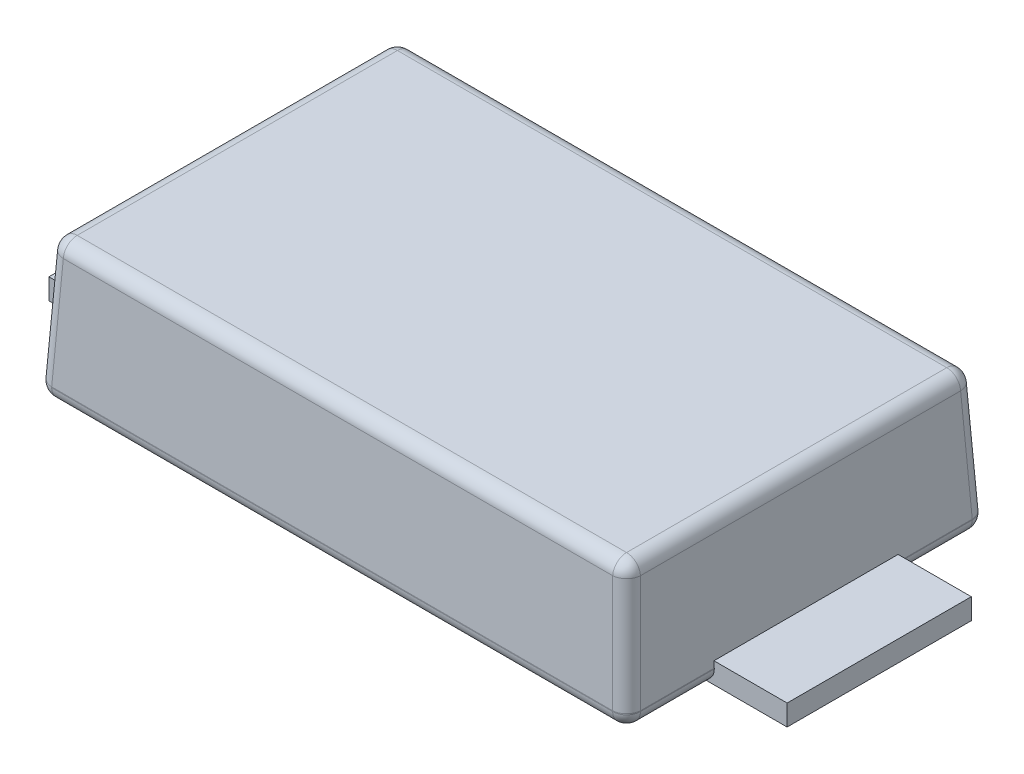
ISO-10303-21;
HEADER;
FILE_DESCRIPTION(('STEP AP214'),'2;1');
FILE_NAME('part.step','',(''),(''),'','','');
FILE_SCHEMA(('AUTOMOTIVE_DESIGN { 1 0 10303 214 1 1 1 1 }'));
ENDSEC;
DATA;
#1=APPLICATION_CONTEXT('core data for automotive mechanical design processes');
#2=APPLICATION_PROTOCOL_DEFINITION('international standard','automotive_design',2000,#1);
#3=PRODUCT_CONTEXT('',#1,'mechanical');
#4=PRODUCT('Part','Part','',(#3));
#5=PRODUCT_RELATED_PRODUCT_CATEGORY('part','',(#4));
#6=PRODUCT_DEFINITION_FORMATION('','',#4);
#7=PRODUCT_DEFINITION_CONTEXT('part definition',#1,'design');
#8=PRODUCT_DEFINITION('design','',#6,#7);
#9=PRODUCT_DEFINITION_SHAPE('','',#8);
#10=(LENGTH_UNIT() NAMED_UNIT(*) SI_UNIT(.MILLI.,.METRE.));
#11=(NAMED_UNIT(*) PLANE_ANGLE_UNIT() SI_UNIT($,.RADIAN.));
#12=(NAMED_UNIT(*) SI_UNIT($,.STERADIAN.) SOLID_ANGLE_UNIT());
#13=UNCERTAINTY_MEASURE_WITH_UNIT(LENGTH_MEASURE(1.E-05),#10,'distance_accuracy_value','');
#14=(GEOMETRIC_REPRESENTATION_CONTEXT(3) GLOBAL_UNCERTAINTY_ASSIGNED_CONTEXT((#13)) GLOBAL_UNIT_ASSIGNED_CONTEXT((#10,
#11,#12)) REPRESENTATION_CONTEXT('',''));
#15=CARTESIAN_POINT('',(0.,0.,0.));
#16=DIRECTION('',(0.,0.,1.));
#17=DIRECTION('',(1.,0.,0.));
#18=AXIS2_PLACEMENT_3D('',#15,#16,#17);
#19=CARTESIAN_POINT('',(3.187587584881,0.,0.663));
#20=DIRECTION('',(-1.,0.,0.));
#21=DIRECTION('',(0.,0.,1.));
#22=AXIS2_PLACEMENT_3D('',#19,#20,#21);
#23=PLANE('',#22);
#24=DIRECTION('',(0.,1.,0.));
#25=VECTOR('',#24,1.);
#26=CARTESIAN_POINT('',(3.187587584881,0.,-0.663));
#27=LINE('',#26,#25);
#28=CARTESIAN_POINT('',(3.187587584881,-0.15,-0.663));
#29=VERTEX_POINT('',#28);
#30=CARTESIAN_POINT('',(3.187587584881,0.,-0.663));
#31=VERTEX_POINT('',#30);
#32=EDGE_CURVE('E481',#29,#31,#27,.T.);
#33=ORIENTED_EDGE('',*,*,#32,.T.);
#34=DIRECTION('',(0.,0.,-1.));
#35=VECTOR('',#34,1.);
#36=CARTESIAN_POINT('',(3.187587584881,0.,0.663));
#37=LINE('',#36,#35);
#38=CARTESIAN_POINT('',(3.187587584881,0.,0.663));
#39=VERTEX_POINT('',#38);
#40=EDGE_CURVE('E601',#39,#31,#37,.T.);
#41=ORIENTED_EDGE('',*,*,#40,.F.);
#42=DIRECTION('',(0.,1.,0.));
#43=VECTOR('',#42,1.);
#44=CARTESIAN_POINT('',(3.187587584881,0.,0.663));
#45=LINE('',#44,#43);
#46=CARTESIAN_POINT('',(3.187587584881,-0.15,0.663));
#47=VERTEX_POINT('',#46);
#48=EDGE_CURVE('E19',#47,#39,#45,.T.);
#49=ORIENTED_EDGE('',*,*,#48,.F.);
#50=DIRECTION('',(0.,0.,-1.));
#51=VECTOR('',#50,1.);
#52=CARTESIAN_POINT('',(3.187587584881,-0.15,0.663));
#53=LINE('',#52,#51);
#54=EDGE_CURVE('E10',#47,#29,#53,.T.);
#55=ORIENTED_EDGE('',*,*,#54,.T.);
#56=EDGE_LOOP('',(#33,#41,#49,#55));
#57=FACE_BOUND('',#56,.T.);
#58=ADVANCED_FACE('F16',(#57),#23,.F.);
#59=CARTESIAN_POINT('',(3.187587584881,-0.15,0.663));
#60=DIRECTION('',(0.,1.,0.));
#61=DIRECTION('',(1.,0.,0.));
#62=AXIS2_PLACEMENT_3D('',#59,#60,#61);
#63=PLANE('',#62);
#64=DIRECTION('',(1.,0.,0.));
#65=VECTOR('',#64,1.);
#66=CARTESIAN_POINT('',(3.187587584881,-0.15,-0.663));
#67=LINE('',#66,#65);
#68=CARTESIAN_POINT('',(2.216587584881,-0.15,-0.663));
#69=VERTEX_POINT('',#68);
#70=CARTESIAN_POINT('',(2.563121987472,-0.15,-0.663));
#71=VERTEX_POINT('',#70);
#72=EDGE_CURVE('E466',#69,#71,#67,.T.);
#73=ORIENTED_EDGE('',*,*,#72,.T.);
#74=DIRECTION('',(1.,0.,0.));
#75=VECTOR('',#74,1.);
#76=CARTESIAN_POINT('',(3.187587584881,-0.15,-0.663));
#77=LINE('',#76,#75);
#78=EDGE_CURVE('E484',#71,#29,#77,.T.);
#79=ORIENTED_EDGE('',*,*,#78,.T.);
#80=ORIENTED_EDGE('',*,*,#54,.F.);
#81=DIRECTION('',(1.,0.,0.));
#82=VECTOR('',#81,1.);
#83=CARTESIAN_POINT('',(3.187587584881,-0.15,0.663));
#84=LINE('',#83,#82);
#85=CARTESIAN_POINT('',(2.563121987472,-0.15,0.663));
#86=VERTEX_POINT('',#85);
#87=EDGE_CURVE('E662',#86,#47,#84,.T.);
#88=ORIENTED_EDGE('',*,*,#87,.F.);
#89=DIRECTION('',(1.,0.,0.));
#90=VECTOR('',#89,1.);
#91=CARTESIAN_POINT('',(3.187587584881,-0.15,0.663));
#92=LINE('',#91,#90);
#93=CARTESIAN_POINT('',(2.216587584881,-0.15,0.663));
#94=VERTEX_POINT('',#93);
#95=EDGE_CURVE('E497',#94,#86,#92,.T.);
#96=ORIENTED_EDGE('',*,*,#95,.F.);
#97=DIRECTION('',(0.,0.,-1.));
#98=VECTOR('',#97,1.);
#99=CARTESIAN_POINT('',(2.216587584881,-0.15,0.663));
#100=LINE('',#99,#98);
#101=EDGE_CURVE('E470',#94,#69,#100,.T.);
#102=ORIENTED_EDGE('',*,*,#101,.T.);
#103=EDGE_LOOP('',(#73,#79,#80,#88,#96,#102));
#104=FACE_BOUND('',#103,.T.);
#105=ADVANCED_FACE('F748',(#104),#63,.F.);
#106=CARTESIAN_POINT('',(1.417,0.15,0.663));
#107=DIRECTION('',(0.,0.,-1.));
#108=DIRECTION('',(0.,-1.,0.));
#109=AXIS2_PLACEMENT_3D('',#106,#107,#108);
#110=PLANE('',#109);
#111=DIRECTION('',(0.0523359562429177,-0.998629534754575,0.));
#112=VECTOR('',#111,1.);
#113=CARTESIAN_POINT('',(2.6685,-0.15,0.663));
#114=LINE('',#113,#112);
#115=CARTESIAN_POINT('',(2.660638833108,0.,0.663));
#116=VERTEX_POINT('',#115);
#117=CARTESIAN_POINT('',(2.662984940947,-0.04476640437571,0.663));
#118=VERTEX_POINT('',#117);
#119=EDGE_CURVE('E465',#116,#118,#114,.T.);
#120=ORIENTED_EDGE('',*,*,#119,.T.);
#121=CARTESIAN_POINT('',(2.563121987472,-0.05,0.663));
#122=DIRECTION('',(0.,0.,-1.));
#123=DIRECTION('',(-1.,0.,0.));
#124=AXIS2_PLACEMENT_3D('',#121,#122,#123);
#125=CIRCLE('',#124,0.1);
#126=CARTESIAN_POINT('',(2.663121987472,-0.05,0.663));
#127=VERTEX_POINT('',#126);
#128=EDGE_CURVE('E418',#118,#127,#125,.T.);
#129=ORIENTED_EDGE('',*,*,#128,.T.);
#130=CARTESIAN_POINT('',(2.563121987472,-0.05,0.663));
#131=DIRECTION('',(0.,0.,-1.));
#132=DIRECTION('',(-1.,0.,0.));
#133=AXIS2_PLACEMENT_3D('',#130,#131,#132);
#134=CIRCLE('',#133,0.1);
#135=EDGE_CURVE('E342',#127,#86,#134,.T.);
#136=ORIENTED_EDGE('',*,*,#135,.T.);
#137=ORIENTED_EDGE('',*,*,#87,.T.);
#138=ORIENTED_EDGE('',*,*,#48,.T.);
#139=DIRECTION('',(-1.,0.,0.));
#140=VECTOR('',#139,1.);
#141=CARTESIAN_POINT('',(2.276138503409,0.,0.663));
#142=LINE('',#141,#140);
#143=EDGE_CURVE('E453',#39,#116,#142,.T.);
#144=ORIENTED_EDGE('',*,*,#143,.T.);
#145=EDGE_LOOP('',(#120,#129,#136,#137,#138,#144));
#146=FACE_BOUND('',#145,.T.);
#147=ADVANCED_FACE('F672',(#146),#110,.F.);
#148=CARTESIAN_POINT('',(1.417,0.15,-0.663));
#149=DIRECTION('',(0.,0.,-1.));
#150=DIRECTION('',(0.,-1.,0.));
#151=AXIS2_PLACEMENT_3D('',#148,#149,#150);
#152=PLANE('',#151);
#153=CARTESIAN_POINT('',(2.563121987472,-0.05,-0.663));
#154=DIRECTION('',(0.,0.,1.));
#155=DIRECTION('',(-1.,0.,0.));
#156=AXIS2_PLACEMENT_3D('',#153,#154,#155);
#157=CIRCLE('',#156,0.1);
#158=CARTESIAN_POINT('',(2.663121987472,-0.05,-0.663));
#159=VERTEX_POINT('',#158);
#160=EDGE_CURVE('E284',#71,#159,#157,.T.);
#161=ORIENTED_EDGE('',*,*,#160,.T.);
#162=CARTESIAN_POINT('',(2.563121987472,-0.05,-0.663));
#163=DIRECTION('',(0.,0.,1.));
#164=DIRECTION('',(-1.,0.,0.));
#165=AXIS2_PLACEMENT_3D('',#162,#163,#164);
#166=CIRCLE('',#165,0.1);
#167=CARTESIAN_POINT('',(2.662984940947,-0.04476640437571,-0.663));
#168=VERTEX_POINT('',#167);
#169=EDGE_CURVE('E542',#159,#168,#166,.T.);
#170=ORIENTED_EDGE('',*,*,#169,.T.);
#171=DIRECTION('',(0.0523359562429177,-0.998629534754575,0.));
#172=VECTOR('',#171,1.);
#173=CARTESIAN_POINT('',(2.6685,-0.15,-0.663));
#174=LINE('',#173,#172);
#175=CARTESIAN_POINT('',(2.660638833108,0.,-0.663));
#176=VERTEX_POINT('',#175);
#177=EDGE_CURVE('E553',#176,#168,#174,.T.);
#178=ORIENTED_EDGE('',*,*,#177,.F.);
#179=DIRECTION('',(-1.,0.,0.));
#180=VECTOR('',#179,1.);
#181=CARTESIAN_POINT('',(2.276138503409,0.,-0.663));
#182=LINE('',#181,#180);
#183=EDGE_CURVE('E485',#31,#176,#182,.T.);
#184=ORIENTED_EDGE('',*,*,#183,.F.);
#185=ORIENTED_EDGE('',*,*,#32,.F.);
#186=ORIENTED_EDGE('',*,*,#78,.F.);
#187=EDGE_LOOP('',(#161,#170,#178,#184,#185,#186));
#188=FACE_BOUND('',#187,.T.);
#189=ADVANCED_FACE('F747',(#188),#152,.T.);
#190=CARTESIAN_POINT('',(2.276138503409,0.,0.663));
#191=DIRECTION('',(0.,-1.,0.));
#192=DIRECTION('',(0.,0.,-1.));
#193=AXIS2_PLACEMENT_3D('',#190,#191,#192);
#194=PLANE('',#193);
#195=DIRECTION('',(0.,0.,1.));
#196=VECTOR('',#195,1.);
#197=CARTESIAN_POINT('',(2.660638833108,0.,-1.3));
#198=LINE('',#197,#196);
#199=EDGE_CURVE('E550',#176,#116,#198,.T.);
#200=ORIENTED_EDGE('',*,*,#199,.T.);
#201=ORIENTED_EDGE('',*,*,#143,.F.);
#202=ORIENTED_EDGE('',*,*,#40,.T.);
#203=ORIENTED_EDGE('',*,*,#183,.T.);
#204=EDGE_LOOP('',(#200,#201,#202,#203));
#205=FACE_BOUND('',#204,.T.);
#206=ADVANCED_FACE('F677',(#205),#194,.F.);
#207=CARTESIAN_POINT('',(-2.127861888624,-0.15,0.663));
#208=DIRECTION('',(0.,1.,0.));
#209=DIRECTION('',(1.,0.,0.));
#210=AXIS2_PLACEMENT_3D('',#207,#208,#209);
#211=PLANE('',#210);
#212=DIRECTION('',(1.,0.,0.));
#213=VECTOR('',#212,1.);
#214=CARTESIAN_POINT('',(-2.127861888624,-0.15,-0.663));
#215=LINE('',#214,#213);
#216=CARTESIAN_POINT('',(-2.127861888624,-0.15,-0.663));
#217=VERTEX_POINT('',#216);
#218=CARTESIAN_POINT('',(-1.476121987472,-0.15,-0.663));
#219=VERTEX_POINT('',#218);
#220=EDGE_CURVE('E610',#217,#219,#215,.T.);
#221=ORIENTED_EDGE('',*,*,#220,.T.);
#222=DIRECTION('',(-1.,0.,0.));
#223=VECTOR('',#222,1.);
#224=CARTESIAN_POINT('',(-1.5815,-0.15,-0.663));
#225=LINE('',#224,#223);
#226=CARTESIAN_POINT('',(-1.156861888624,-0.15,-0.663));
#227=VERTEX_POINT('',#226);
#228=EDGE_CURVE('E510',#227,#219,#225,.T.);
#229=ORIENTED_EDGE('',*,*,#228,.F.);
#230=DIRECTION('',(0.,0.,-1.));
#231=VECTOR('',#230,1.);
#232=CARTESIAN_POINT('',(-1.156861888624,-0.15,0.663));
#233=LINE('',#232,#231);
#234=CARTESIAN_POINT('',(-1.156861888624,-0.15,0.663));
#235=VERTEX_POINT('',#234);
#236=EDGE_CURVE('E506',#235,#227,#233,.T.);
#237=ORIENTED_EDGE('',*,*,#236,.F.);
#238=DIRECTION('',(-1.,0.,0.));
#239=VECTOR('',#238,1.);
#240=CARTESIAN_POINT('',(-1.5815,-0.15,0.663));
#241=LINE('',#240,#239);
#242=CARTESIAN_POINT('',(-1.476121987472,-0.15,0.663));
#243=VERTEX_POINT('',#242);
#244=EDGE_CURVE('E511',#235,#243,#241,.T.);
#245=ORIENTED_EDGE('',*,*,#244,.T.);
#246=DIRECTION('',(1.,0.,0.));
#247=VECTOR('',#246,1.);
#248=CARTESIAN_POINT('',(-2.127861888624,-0.15,0.663));
#249=LINE('',#248,#247);
#250=CARTESIAN_POINT('',(-2.127861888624,-0.15,0.663));
#251=VERTEX_POINT('',#250);
#252=EDGE_CURVE('E528',#251,#243,#249,.T.);
#253=ORIENTED_EDGE('',*,*,#252,.F.);
#254=DIRECTION('',(0.,0.,-1.));
#255=VECTOR('',#254,1.);
#256=CARTESIAN_POINT('',(-2.127861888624,-0.15,0.663));
#257=LINE('',#256,#255);
#258=EDGE_CURVE('E450',#251,#217,#257,.T.);
#259=ORIENTED_EDGE('',*,*,#258,.T.);
#260=EDGE_LOOP('',(#221,#229,#237,#245,#253,#259));
#261=FACE_BOUND('',#260,.T.);
#262=ADVANCED_FACE('F720',(#261),#211,.F.);
#263=CARTESIAN_POINT('',(-2.127861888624,0.,0.663));
#264=DIRECTION('',(1.,0.,0.));
#265=DIRECTION('',(0.,1.,0.));
#266=AXIS2_PLACEMENT_3D('',#263,#264,#265);
#267=PLANE('',#266);
#268=DIRECTION('',(0.,-1.,0.));
#269=VECTOR('',#268,1.);
#270=CARTESIAN_POINT('',(-2.127861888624,0.,-0.663));
#271=LINE('',#270,#269);
#272=CARTESIAN_POINT('',(-2.127861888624,0.,-0.663));
#273=VERTEX_POINT('',#272);
#274=EDGE_CURVE('E454',#273,#217,#271,.T.);
#275=ORIENTED_EDGE('',*,*,#274,.T.);
#276=ORIENTED_EDGE('',*,*,#258,.F.);
#277=DIRECTION('',(0.,-1.,0.));
#278=VECTOR('',#277,1.);
#279=CARTESIAN_POINT('',(-2.127861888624,0.,0.663));
#280=LINE('',#279,#278);
#281=CARTESIAN_POINT('',(-2.127861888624,0.,0.663));
#282=VERTEX_POINT('',#281);
#283=EDGE_CURVE('E524',#282,#251,#280,.T.);
#284=ORIENTED_EDGE('',*,*,#283,.F.);
#285=DIRECTION('',(0.,0.,-1.));
#286=VECTOR('',#285,1.);
#287=CARTESIAN_POINT('',(-2.127861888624,0.,0.663));
#288=LINE('',#287,#286);
#289=EDGE_CURVE('E529',#282,#273,#288,.T.);
#290=ORIENTED_EDGE('',*,*,#289,.T.);
#291=EDGE_LOOP('',(#275,#276,#284,#290));
#292=FACE_BOUND('',#291,.T.);
#293=ADVANCED_FACE('F764',(#292),#267,.F.);
#294=CARTESIAN_POINT('',(-0.965,0.,-0.663));
#295=DIRECTION('',(0.,0.,-1.));
#296=DIRECTION('',(0.,-1.,0.));
#297=AXIS2_PLACEMENT_3D('',#294,#295,#296);
#298=PLANE('',#297);
#299=DIRECTION('',(0.0523359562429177,0.998629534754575,0.));
#300=VECTOR('',#299,1.);
#301=CARTESIAN_POINT('',(-1.5815,-0.15,-0.663));
#302=LINE('',#301,#300);
#303=CARTESIAN_POINT('',(-1.575984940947,-0.04476640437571,-0.663));
#304=VERTEX_POINT('',#303);
#305=CARTESIAN_POINT('',(-1.573638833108,0.,-0.663));
#306=VERTEX_POINT('',#305);
#307=EDGE_CURVE('E359',#304,#306,#302,.T.);
#308=ORIENTED_EDGE('',*,*,#307,.F.);
#309=CARTESIAN_POINT('',(-1.476121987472,-0.05,-0.663));
#310=DIRECTION('',(0.,0.,1.));
#311=DIRECTION('',(-1.,0.,0.));
#312=AXIS2_PLACEMENT_3D('',#309,#310,#311);
#313=CIRCLE('',#312,0.1);
#314=CARTESIAN_POINT('',(-1.576121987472,-0.05,-0.663));
#315=VERTEX_POINT('',#314);
#316=EDGE_CURVE('E460',#304,#315,#313,.T.);
#317=ORIENTED_EDGE('',*,*,#316,.T.);
#318=CARTESIAN_POINT('',(-1.476121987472,-0.05,-0.663));
#319=DIRECTION('',(0.,0.,1.));
#320=DIRECTION('',(-1.,0.,0.));
#321=AXIS2_PLACEMENT_3D('',#318,#319,#320);
#322=CIRCLE('',#321,0.1);
#323=EDGE_CURVE('E302',#315,#219,#322,.T.);
#324=ORIENTED_EDGE('',*,*,#323,.T.);
#325=ORIENTED_EDGE('',*,*,#220,.F.);
#326=ORIENTED_EDGE('',*,*,#274,.F.);
#327=DIRECTION('',(-1.,0.,0.));
#328=VECTOR('',#327,1.);
#329=CARTESIAN_POINT('',(-1.240893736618,0.,-0.663));
#330=LINE('',#329,#328);
#331=EDGE_CURVE('E533',#306,#273,#330,.T.);
#332=ORIENTED_EDGE('',*,*,#331,.F.);
#333=EDGE_LOOP('',(#308,#317,#324,#325,#326,#332));
#334=FACE_BOUND('',#333,.T.);
#335=ADVANCED_FACE('F727',(#334),#298,.T.);
#336=CARTESIAN_POINT('',(-0.965,0.,0.663));
#337=DIRECTION('',(0.,0.,-1.));
#338=DIRECTION('',(0.,-1.,0.));
#339=AXIS2_PLACEMENT_3D('',#336,#337,#338);
#340=PLANE('',#339);
#341=CARTESIAN_POINT('',(-1.476121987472,-0.05,0.663));
#342=DIRECTION('',(0.,0.,-1.));
#343=DIRECTION('',(-1.,0.,0.));
#344=AXIS2_PLACEMENT_3D('',#341,#342,#343);
#345=CIRCLE('',#344,0.1);
#346=CARTESIAN_POINT('',(-1.576121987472,-0.05,0.663));
#347=VERTEX_POINT('',#346);
#348=EDGE_CURVE('E374',#243,#347,#345,.T.);
#349=ORIENTED_EDGE('',*,*,#348,.T.);
#350=CARTESIAN_POINT('',(-1.476121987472,-0.05,0.663));
#351=DIRECTION('',(0.,0.,-1.));
#352=DIRECTION('',(-1.,0.,0.));
#353=AXIS2_PLACEMENT_3D('',#350,#351,#352);
#354=CIRCLE('',#353,0.1);
#355=CARTESIAN_POINT('',(-1.575984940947,-0.04476640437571,0.663));
#356=VERTEX_POINT('',#355);
#357=EDGE_CURVE('E404',#347,#356,#354,.T.);
#358=ORIENTED_EDGE('',*,*,#357,.T.);
#359=DIRECTION('',(0.0523359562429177,0.998629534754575,0.));
#360=VECTOR('',#359,1.);
#361=CARTESIAN_POINT('',(-1.5815,-0.15,0.663));
#362=LINE('',#361,#360);
#363=CARTESIAN_POINT('',(-1.573638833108,0.,0.663));
#364=VERTEX_POINT('',#363);
#365=EDGE_CURVE('E449',#356,#364,#362,.T.);
#366=ORIENTED_EDGE('',*,*,#365,.T.);
#367=DIRECTION('',(-1.,0.,0.));
#368=VECTOR('',#367,1.);
#369=CARTESIAN_POINT('',(-1.240893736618,0.,0.663));
#370=LINE('',#369,#368);
#371=EDGE_CURVE('E647',#364,#282,#370,.T.);
#372=ORIENTED_EDGE('',*,*,#371,.T.);
#373=ORIENTED_EDGE('',*,*,#283,.T.);
#374=ORIENTED_EDGE('',*,*,#252,.T.);
#375=EDGE_LOOP('',(#349,#358,#366,#372,#373,#374));
#376=FACE_BOUND('',#375,.T.);
#377=ADVANCED_FACE('F767',(#376),#340,.F.);
#378=CARTESIAN_POINT('',(-1.240893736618,0.,0.663));
#379=DIRECTION('',(0.,-1.,0.));
#380=DIRECTION('',(0.,0.,-1.));
#381=AXIS2_PLACEMENT_3D('',#378,#379,#380);
#382=PLANE('',#381);
#383=ORIENTED_EDGE('',*,*,#371,.F.);
#384=DIRECTION('',(0.,0.,-1.));
#385=VECTOR('',#384,1.);
#386=CARTESIAN_POINT('',(-1.573638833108,0.,-1.3));
#387=LINE('',#386,#385);
#388=EDGE_CURVE('E429',#364,#306,#387,.T.);
#389=ORIENTED_EDGE('',*,*,#388,.T.);
#390=ORIENTED_EDGE('',*,*,#331,.T.);
#391=ORIENTED_EDGE('',*,*,#289,.F.);
#392=EDGE_LOOP('',(#383,#389,#390,#391));
#393=FACE_BOUND('',#392,.T.);
#394=ADVANCED_FACE('F770',(#393),#382,.F.);
#395=CARTESIAN_POINT('',(-1.5815,0.75,-1.152695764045));
#396=DIRECTION('',(-1.,0.,0.));
#397=DIRECTION('',(0.,0.,1.));
#398=AXIS2_PLACEMENT_3D('',#395,#396,#397);
#399=CYLINDRICAL_SURFACE('',#398,0.1);
#400=CARTESIAN_POINT('',(2.521195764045,0.75,-1.152695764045));
#401=DIRECTION('',(-1.,0.,0.));
#402=DIRECTION('',(0.,1.,0.));
#403=AXIS2_PLACEMENT_3D('',#400,#401,#402);
#404=CIRCLE('',#403,0.1);
#405=CARTESIAN_POINT('',(2.521195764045,0.85,-1.152695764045));
#406=VERTEX_POINT('',#405);
#407=CARTESIAN_POINT('',(2.521195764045,0.755233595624,-1.252558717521));
#408=VERTEX_POINT('',#407);
#409=EDGE_CURVE('E383',#406,#408,#404,.T.);
#410=ORIENTED_EDGE('',*,*,#409,.T.);
#411=DIRECTION('',(1.,0.,0.));
#412=VECTOR('',#411,1.);
#413=CARTESIAN_POINT('',(2.616092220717,0.755233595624,-1.252558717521));
#414=LINE('',#413,#412);
#415=CARTESIAN_POINT('',(-1.434195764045,0.755233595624,-1.252558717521));
#416=VERTEX_POINT('',#415);
#417=EDGE_CURVE('E571',#416,#408,#414,.T.);
#418=ORIENTED_EDGE('',*,*,#417,.F.);
#419=CARTESIAN_POINT('',(-1.434195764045,0.75,-1.152695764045));
#420=DIRECTION('',(1.,0.,0.));
#421=DIRECTION('',(0.,0.,1.));
#422=AXIS2_PLACEMENT_3D('',#419,#420,#421);
#423=CIRCLE('',#422,0.1);
#424=CARTESIAN_POINT('',(-1.434195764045,0.85,-1.152695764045));
#425=VERTEX_POINT('',#424);
#426=EDGE_CURVE('E386',#416,#425,#423,.T.);
#427=ORIENTED_EDGE('',*,*,#426,.T.);
#428=DIRECTION('',(-1.,0.,0.));
#429=VECTOR('',#428,1.);
#430=CARTESIAN_POINT('',(-1.529092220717,0.85,-1.152695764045));
#431=LINE('',#430,#429);
#432=EDGE_CURVE('E490',#406,#425,#431,.T.);
#433=ORIENTED_EDGE('',*,*,#432,.F.);
#434=EDGE_LOOP('',(#410,#418,#427,#433));
#435=FACE_BOUND('',#434,.T.);
#436=ADVANCED_FACE('F774',(#435),#399,.T.);
#437=CARTESIAN_POINT('',(-1.434195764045,0.75,-1.152695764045));
#438=DIRECTION('',(0.,1.,0.));
#439=DIRECTION('',(1.,0.,0.));
#440=AXIS2_PLACEMENT_3D('',#437,#438,#439);
#441=SPHERICAL_SURFACE('',#440,0.1);
#442=CARTESIAN_POINT('',(-1.434195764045,0.75,-1.152695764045));
#443=DIRECTION('',(0.0522644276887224,0.997264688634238,0.0522644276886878));
#444=DIRECTION('',(0.,-0.0523359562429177,0.998629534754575));
#445=AXIS2_PLACEMENT_3D('',#442,#443,#444);
#446=CIRCLE('',#445,0.1);
#447=CARTESIAN_POINT('',(-1.534058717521,0.755233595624,-1.152695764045));
#448=VERTEX_POINT('',#447);
#449=EDGE_CURVE('E387',#416,#448,#446,.T.);
#450=ORIENTED_EDGE('',*,*,#449,.T.);
#451=CARTESIAN_POINT('',(-1.434195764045,0.75,-1.152695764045));
#452=DIRECTION('',(0.,0.,-1.));
#453=DIRECTION('',(-1.,0.,0.));
#454=AXIS2_PLACEMENT_3D('',#451,#452,#453);
#455=CIRCLE('',#454,0.1);
#456=EDGE_CURVE('E639',#448,#425,#455,.T.);
#457=ORIENTED_EDGE('',*,*,#456,.T.);
#458=ORIENTED_EDGE('',*,*,#426,.F.);
#459=EDGE_LOOP('',(#450,#457,#458));
#460=FACE_BOUND('',#459,.T.);
#461=ADVANCED_FACE('F778',(#460),#441,.T.);
#462=CARTESIAN_POINT('',(2.521195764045,0.75,-1.152695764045));
#463=DIRECTION('',(0.,1.,0.));
#464=DIRECTION('',(1.,0.,0.));
#465=AXIS2_PLACEMENT_3D('',#462,#463,#464);
#466=SPHERICAL_SURFACE('',#465,0.1);
#467=CARTESIAN_POINT('',(2.521195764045,0.75,-1.152695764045));
#468=DIRECTION('',(0.,0.,-1.));
#469=DIRECTION('',(-1.,0.,0.));
#470=AXIS2_PLACEMENT_3D('',#467,#468,#469);
#471=CIRCLE('',#470,0.1);
#472=CARTESIAN_POINT('',(2.621058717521,0.755233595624,-1.152695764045));
#473=VERTEX_POINT('',#472);
#474=EDGE_CURVE('E576',#406,#473,#471,.T.);
#475=ORIENTED_EDGE('',*,*,#474,.T.);
#476=CARTESIAN_POINT('',(2.521195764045,0.75,-1.152695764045));
#477=DIRECTION('',(-0.0522644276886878,0.997264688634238,0.0522644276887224));
#478=DIRECTION('',(-0.998629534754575,-0.0523359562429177,0.));
#479=AXIS2_PLACEMENT_3D('',#476,#477,#478);
#480=CIRCLE('',#479,0.1);
#481=EDGE_CURVE('E572',#473,#408,#480,.T.);
#482=ORIENTED_EDGE('',*,*,#481,.T.);
#483=ORIENTED_EDGE('',*,*,#409,.F.);
#484=EDGE_LOOP('',(#475,#482,#483));
#485=FACE_BOUND('',#484,.T.);
#486=ADVANCED_FACE('F780',(#485),#466,.T.);
#487=CARTESIAN_POINT('',(-1.481909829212,-0.160438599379,-1.200409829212));
#488=DIRECTION('',(-0.0522644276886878,-0.997264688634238,-0.0522644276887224));
#489=DIRECTION('',(0.998629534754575,-0.0523359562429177,0.));
#490=AXIS2_PLACEMENT_3D('',#487,#488,#489);
#491=CYLINDRICAL_SURFACE('',#490,0.1);
#492=CARTESIAN_POINT('',(-1.476121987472,-0.05,-1.194621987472));
#493=DIRECTION('',(0.0522644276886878,0.997264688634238,0.0522644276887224));
#494=DIRECTION('',(0.998629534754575,-0.0523359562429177,0.));
#495=AXIS2_PLACEMENT_3D('',#492,#493,#494);
#496=CIRCLE('',#495,0.1);
#497=CARTESIAN_POINT('',(-1.476121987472,-0.04476640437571,-1.294484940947));
#498=VERTEX_POINT('',#497);
#499=CARTESIAN_POINT('',(-1.575984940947,-0.04476640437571,-1.194621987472));
#500=VERTEX_POINT('',#499);
#501=EDGE_CURVE('E577',#498,#500,#496,.T.);
#502=ORIENTED_EDGE('',*,*,#501,.T.);
#503=DIRECTION('',(-0.0522644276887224,-0.997264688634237,-0.0522644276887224));
#504=VECTOR('',#503,1.);
#505=CARTESIAN_POINT('',(-1.581772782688,-0.155205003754,-1.200409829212));
#506=LINE('',#505,#504);
#507=EDGE_CURVE('E360',#448,#500,#506,.T.);
#508=ORIENTED_EDGE('',*,*,#507,.F.);
#509=ORIENTED_EDGE('',*,*,#449,.F.);
#510=DIRECTION('',(0.0522644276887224,0.997264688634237,0.0522644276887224));
#511=VECTOR('',#510,1.);
#512=CARTESIAN_POINT('',(-1.481909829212,-0.155205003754,-1.300272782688));
#513=LINE('',#512,#511);
#514=EDGE_CURVE('E564',#498,#416,#513,.T.);
#515=ORIENTED_EDGE('',*,*,#514,.F.);
#516=EDGE_LOOP('',(#502,#508,#509,#515));
#517=FACE_BOUND('',#516,.T.);
#518=ADVANCED_FACE('F783',(#517),#491,.T.);
#519=CARTESIAN_POINT('',(-1.434195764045,0.75,1.3));
#520=DIRECTION('',(0.,0.,1.));
#521=DIRECTION('',(1.,0.,0.));
#522=AXIS2_PLACEMENT_3D('',#519,#520,#521);
#523=CYLINDRICAL_SURFACE('',#522,0.1);
#524=CARTESIAN_POINT('',(-1.434195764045,0.75,1.152695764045));
#525=DIRECTION('',(0.,0.,-1.));
#526=DIRECTION('',(1.,0.,0.));
#527=AXIS2_PLACEMENT_3D('',#524,#525,#526);
#528=CIRCLE('',#527,0.1);
#529=CARTESIAN_POINT('',(-1.534058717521,0.755233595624,1.152695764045));
#530=VERTEX_POINT('',#529);
#531=CARTESIAN_POINT('',(-1.434195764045,0.85,1.152695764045));
#532=VERTEX_POINT('',#531);
#533=EDGE_CURVE('E632',#530,#532,#528,.T.);
#534=ORIENTED_EDGE('',*,*,#533,.T.);
#535=DIRECTION('',(0.,0.,1.));
#536=VECTOR('',#535,1.);
#537=CARTESIAN_POINT('',(-1.434195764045,0.85,1.247592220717));
#538=LINE('',#537,#536);
#539=EDGE_CURVE('E440',#425,#532,#538,.T.);
#540=ORIENTED_EDGE('',*,*,#539,.F.);
#541=ORIENTED_EDGE('',*,*,#456,.F.);
#542=DIRECTION('',(0.,0.,-1.));
#543=VECTOR('',#542,1.);
#544=CARTESIAN_POINT('',(-1.534058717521,0.755233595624,-1.247592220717));
#545=LINE('',#544,#543);
#546=EDGE_CURVE('E352',#530,#448,#545,.T.);
#547=ORIENTED_EDGE('',*,*,#546,.F.);
#548=EDGE_LOOP('',(#534,#540,#541,#547));
#549=FACE_BOUND('',#548,.T.);
#550=ADVANCED_FACE('F787',(#549),#523,.T.);
#551=CARTESIAN_POINT('',(2.521195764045,0.75,1.3));
#552=DIRECTION('',(0.,0.,-1.));
#553=DIRECTION('',(-1.,0.,0.));
#554=AXIS2_PLACEMENT_3D('',#551,#552,#553);
#555=CYLINDRICAL_SURFACE('',#554,0.1);
#556=CARTESIAN_POINT('',(2.521195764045,0.75,1.152695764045));
#557=DIRECTION('',(0.,0.,-1.));
#558=DIRECTION('',(0.,-1.,0.));
#559=AXIS2_PLACEMENT_3D('',#556,#557,#558);
#560=CIRCLE('',#559,0.1);
#561=CARTESIAN_POINT('',(2.521195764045,0.85,1.152695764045));
#562=VERTEX_POINT('',#561);
#563=CARTESIAN_POINT('',(2.621058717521,0.755233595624,1.152695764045));
#564=VERTEX_POINT('',#563);
#565=EDGE_CURVE('E591',#562,#564,#560,.T.);
#566=ORIENTED_EDGE('',*,*,#565,.T.);
#567=DIRECTION('',(0.,0.,1.));
#568=VECTOR('',#567,1.);
#569=CARTESIAN_POINT('',(2.621058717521,0.755233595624,1.247592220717));
#570=LINE('',#569,#568);
#571=EDGE_CURVE('E394',#473,#564,#570,.T.);
#572=ORIENTED_EDGE('',*,*,#571,.F.);
#573=ORIENTED_EDGE('',*,*,#474,.F.);
#574=DIRECTION('',(0.,0.,-1.));
#575=VECTOR('',#574,1.);
#576=CARTESIAN_POINT('',(2.521195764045,0.85,-1.247592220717));
#577=LINE('',#576,#575);
#578=EDGE_CURVE('E486',#562,#406,#577,.T.);
#579=ORIENTED_EDGE('',*,*,#578,.F.);
#580=EDGE_LOOP('',(#566,#572,#573,#579));
#581=FACE_BOUND('',#580,.T.);
#582=ADVANCED_FACE('F789',(#581),#555,.T.);
#583=CARTESIAN_POINT('',(2.557300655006,0.06107764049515,-1.188800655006));
#584=DIRECTION('',(0.0522644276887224,-0.997264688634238,-0.0522644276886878));
#585=DIRECTION('',(0.,0.0523359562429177,-0.998629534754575));
#586=AXIS2_PLACEMENT_3D('',#583,#584,#585);
#587=CYLINDRICAL_SURFACE('',#586,0.1);
#588=CARTESIAN_POINT('',(2.563121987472,-0.05,-1.194621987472));
#589=DIRECTION('',(-0.0522644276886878,0.997264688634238,0.0522644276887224));
#590=DIRECTION('',(0.998629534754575,0.0523359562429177,0.));
#591=AXIS2_PLACEMENT_3D('',#588,#589,#590);
#592=CIRCLE('',#591,0.1);
#593=CARTESIAN_POINT('',(2.662984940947,-0.04476640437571,-1.194621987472));
#594=VERTEX_POINT('',#593);
#595=CARTESIAN_POINT('',(2.563121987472,-0.04476640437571,-1.294484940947));
#596=VERTEX_POINT('',#595);
#597=EDGE_CURVE('E588',#594,#596,#592,.T.);
#598=ORIENTED_EDGE('',*,*,#597,.T.);
#599=DIRECTION('',(0.0522644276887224,-0.997264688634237,-0.0522644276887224));
#600=VECTOR('',#599,1.);
#601=CARTESIAN_POINT('',(2.557300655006,0.06631123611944,-1.288663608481));
#602=LINE('',#601,#600);
#603=EDGE_CURVE('E581',#408,#596,#602,.T.);
#604=ORIENTED_EDGE('',*,*,#603,.F.);
#605=ORIENTED_EDGE('',*,*,#481,.F.);
#606=DIRECTION('',(-0.0522644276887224,0.997264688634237,0.0522644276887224));
#607=VECTOR('',#606,1.);
#608=CARTESIAN_POINT('',(2.668772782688,-0.155205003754,-1.200409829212));
#609=LINE('',#608,#607);
#610=EDGE_CURVE('E390',#594,#473,#609,.T.);
#611=ORIENTED_EDGE('',*,*,#610,.F.);
#612=EDGE_LOOP('',(#598,#604,#605,#611));
#613=FACE_BOUND('',#612,.T.);
#614=ADVANCED_FACE('F792',(#613),#587,.T.);
#615=CARTESIAN_POINT('',(-1.476121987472,-0.05,-1.194621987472));
#616=DIRECTION('',(0.,1.,0.));
#617=DIRECTION('',(1.,0.,0.));
#618=AXIS2_PLACEMENT_3D('',#615,#616,#617);
#619=SPHERICAL_SURFACE('',#618,0.1);
#620=CARTESIAN_POINT('',(-1.476121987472,-0.05,-1.194621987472));
#621=DIRECTION('',(-1.,0.,0.));
#622=DIRECTION('',(0.,-1.,0.));
#623=AXIS2_PLACEMENT_3D('',#620,#621,#622);
#624=CIRCLE('',#623,0.1);
#625=CARTESIAN_POINT('',(-1.476121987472,-0.05,-1.294621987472));
#626=VERTEX_POINT('',#625);
#627=EDGE_CURVE('E459',#498,#626,#624,.T.);
#628=ORIENTED_EDGE('',*,*,#627,.T.);
#629=CARTESIAN_POINT('',(-1.476121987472,-0.05,-1.194621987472));
#630=DIRECTION('',(-1.,0.,0.));
#631=DIRECTION('',(0.,-1.,0.));
#632=AXIS2_PLACEMENT_3D('',#629,#630,#631);
#633=CIRCLE('',#632,0.1);
#634=CARTESIAN_POINT('',(-1.476121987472,-0.15,-1.194621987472));
#635=VERTEX_POINT('',#634);
#636=EDGE_CURVE('E312',#626,#635,#633,.T.);
#637=ORIENTED_EDGE('',*,*,#636,.T.);
#638=CARTESIAN_POINT('',(-1.476121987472,-0.05,-1.194621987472));
#639=DIRECTION('',(0.,0.,-1.));
#640=DIRECTION('',(-1.,0.,0.));
#641=AXIS2_PLACEMENT_3D('',#638,#639,#640);
#642=CIRCLE('',#641,0.1);
#643=CARTESIAN_POINT('',(-1.576121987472,-0.05,-1.194621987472));
#644=VERTEX_POINT('',#643);
#645=EDGE_CURVE('E338',#635,#644,#642,.T.);
#646=ORIENTED_EDGE('',*,*,#645,.T.);
#647=CARTESIAN_POINT('',(-1.476121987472,-0.05,-1.194621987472));
#648=DIRECTION('',(0.,0.,-1.));
#649=DIRECTION('',(-1.,0.,0.));
#650=AXIS2_PLACEMENT_3D('',#647,#648,#649);
#651=CIRCLE('',#650,0.1);
#652=EDGE_CURVE('E455',#644,#500,#651,.T.);
#653=ORIENTED_EDGE('',*,*,#652,.T.);
#654=ORIENTED_EDGE('',*,*,#501,.F.);
#655=EDGE_LOOP('',(#628,#637,#646,#653,#654));
#656=FACE_BOUND('',#655,.T.);
#657=ADVANCED_FACE('F733',(#656),#619,.T.);
#658=CARTESIAN_POINT('',(-1.434195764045,0.75,1.152695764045));
#659=DIRECTION('',(0.,1.,0.));
#660=DIRECTION('',(1.,0.,0.));
#661=AXIS2_PLACEMENT_3D('',#658,#659,#660);
#662=SPHERICAL_SURFACE('',#661,0.1);
#663=CARTESIAN_POINT('',(-1.434195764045,0.75,1.152695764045));
#664=DIRECTION('',(0.0522644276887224,0.997264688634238,-0.0522644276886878));
#665=DIRECTION('',(0.,0.0523359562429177,0.998629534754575));
#666=AXIS2_PLACEMENT_3D('',#663,#664,#665);
#667=CIRCLE('',#666,0.1);
#668=CARTESIAN_POINT('',(-1.434195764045,0.755233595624,1.252558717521));
#669=VERTEX_POINT('',#668);
#670=EDGE_CURVE('E504',#530,#669,#667,.T.);
#671=ORIENTED_EDGE('',*,*,#670,.T.);
#672=CARTESIAN_POINT('',(-1.434195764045,0.75,1.152695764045));
#673=DIRECTION('',(-1.,0.,0.));
#674=DIRECTION('',(0.,0.,1.));
#675=AXIS2_PLACEMENT_3D('',#672,#673,#674);
#676=CIRCLE('',#675,0.1);
#677=EDGE_CURVE('E505',#669,#532,#676,.T.);
#678=ORIENTED_EDGE('',*,*,#677,.T.);
#679=ORIENTED_EDGE('',*,*,#533,.F.);
#680=EDGE_LOOP('',(#671,#678,#679));
#681=FACE_BOUND('',#680,.T.);
#682=ADVANCED_FACE('F797',(#681),#662,.T.);
#683=CARTESIAN_POINT('',(2.521195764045,0.75,1.152695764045));
#684=DIRECTION('',(0.,1.,0.));
#685=DIRECTION('',(1.,0.,0.));
#686=AXIS2_PLACEMENT_3D('',#683,#684,#685);
#687=SPHERICAL_SURFACE('',#686,0.1);
#688=CARTESIAN_POINT('',(2.521195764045,0.75,1.152695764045));
#689=DIRECTION('',(1.,0.,0.));
#690=DIRECTION('',(0.,0.,-1.));
#691=AXIS2_PLACEMENT_3D('',#688,#689,#690);
#692=CIRCLE('',#691,0.1);
#693=CARTESIAN_POINT('',(2.521195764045,0.755233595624,1.252558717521));
#694=VERTEX_POINT('',#693);
#695=EDGE_CURVE('E501',#562,#694,#692,.T.);
#696=ORIENTED_EDGE('',*,*,#695,.T.);
#697=CARTESIAN_POINT('',(2.521195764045,0.75,1.152695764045));
#698=DIRECTION('',(-0.0522644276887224,0.997264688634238,-0.0522644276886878));
#699=DIRECTION('',(0.,0.0523359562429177,0.998629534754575));
#700=AXIS2_PLACEMENT_3D('',#697,#698,#699);
#701=CIRCLE('',#700,0.1);
#702=EDGE_CURVE('E592',#694,#564,#701,.T.);
#703=ORIENTED_EDGE('',*,*,#702,.T.);
#704=ORIENTED_EDGE('',*,*,#565,.F.);
#705=EDGE_LOOP('',(#696,#703,#704));
#706=FACE_BOUND('',#705,.T.);
#707=ADVANCED_FACE('F800',(#706),#687,.T.);
#708=CARTESIAN_POINT('',(2.563121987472,-0.05,-1.194621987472));
#709=DIRECTION('',(0.,1.,0.));
#710=DIRECTION('',(1.,0.,0.));
#711=AXIS2_PLACEMENT_3D('',#708,#709,#710);
#712=SPHERICAL_SURFACE('',#711,0.1);
#713=CARTESIAN_POINT('',(2.563121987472,-0.05,-1.194621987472));
#714=DIRECTION('',(0.,-1.,0.));
#715=DIRECTION('',(0.,0.,-1.));
#716=AXIS2_PLACEMENT_3D('',#713,#714,#715);
#717=CIRCLE('',#716,0.1);
#718=CARTESIAN_POINT('',(2.563121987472,-0.05,-1.294621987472));
#719=VERTEX_POINT('',#718);
#720=CARTESIAN_POINT('',(2.663121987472,-0.05,-1.194621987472));
#721=VERTEX_POINT('',#720);
#722=EDGE_CURVE('E310',#719,#721,#717,.T.);
#723=ORIENTED_EDGE('',*,*,#722,.F.);
#724=CARTESIAN_POINT('',(2.563121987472,-0.05,-1.194621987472));
#725=DIRECTION('',(1.,0.,0.));
#726=DIRECTION('',(0.,0.,-1.));
#727=AXIS2_PLACEMENT_3D('',#724,#725,#726);
#728=CIRCLE('',#727,0.1);
#729=EDGE_CURVE('E567',#719,#596,#728,.T.);
#730=ORIENTED_EDGE('',*,*,#729,.T.);
#731=ORIENTED_EDGE('',*,*,#597,.F.);
#732=CARTESIAN_POINT('',(2.563121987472,-0.05,-1.194621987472));
#733=DIRECTION('',(0.,0.,-1.));
#734=DIRECTION('',(-1.,0.,0.));
#735=AXIS2_PLACEMENT_3D('',#732,#733,#734);
#736=CIRCLE('',#735,0.1);
#737=EDGE_CURVE('E539',#594,#721,#736,.T.);
#738=ORIENTED_EDGE('',*,*,#737,.T.);
#739=EDGE_LOOP('',(#723,#730,#731,#738));
#740=FACE_BOUND('',#739,.T.);
#741=ADVANCED_FACE('F739',(#740),#712,.T.);
#742=CARTESIAN_POINT('',(-1.5815,-0.05,-1.194621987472));
#743=DIRECTION('',(1.,0.,0.));
#744=DIRECTION('',(0.,0.,-1.));
#745=AXIS2_PLACEMENT_3D('',#742,#743,#744);
#746=CYLINDRICAL_SURFACE('',#745,0.1);
#747=DIRECTION('',(1.,0.,0.));
#748=VECTOR('',#747,1.);
#749=CARTESIAN_POINT('',(-1.5815,-0.05,-1.294621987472));
#750=LINE('',#749,#748);
#751=EDGE_CURVE('E303',#626,#719,#750,.T.);
#752=ORIENTED_EDGE('',*,*,#751,.F.);
#753=ORIENTED_EDGE('',*,*,#627,.F.);
#754=DIRECTION('',(-1.,0.,0.));
#755=VECTOR('',#754,1.);
#756=CARTESIAN_POINT('',(-1.5815,-0.04476640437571,-1.294484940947));
#757=LINE('',#756,#755);
#758=EDGE_CURVE('E491',#596,#498,#757,.T.);
#759=ORIENTED_EDGE('',*,*,#758,.F.);
#760=ORIENTED_EDGE('',*,*,#729,.F.);
#761=EDGE_LOOP('',(#752,#753,#759,#760));
#762=FACE_BOUND('',#761,.T.);
#763=ADVANCED_FACE('F737',(#762),#746,.T.);
#764=CARTESIAN_POINT('',(-1.476121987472,-0.05,-1.3));
#765=DIRECTION('',(0.,0.,-1.));
#766=DIRECTION('',(-1.,0.,0.));
#767=AXIS2_PLACEMENT_3D('',#764,#765,#766);
#768=CYLINDRICAL_SURFACE('',#767,0.1);
#769=DIRECTION('',(0.,0.,-1.));
#770=VECTOR('',#769,1.);
#771=CARTESIAN_POINT('',(-1.576121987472,-0.05,-1.3));
#772=LINE('',#771,#770);
#773=EDGE_CURVE('E364',#315,#644,#772,.T.);
#774=ORIENTED_EDGE('',*,*,#773,.F.);
#775=ORIENTED_EDGE('',*,*,#316,.F.);
#776=DIRECTION('',(0.,0.,1.));
#777=VECTOR('',#776,1.);
#778=CARTESIAN_POINT('',(-1.575984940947,-0.04476640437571,-1.3));
#779=LINE('',#778,#777);
#780=EDGE_CURVE('E355',#500,#304,#779,.T.);
#781=ORIENTED_EDGE('',*,*,#780,.F.);
#782=ORIENTED_EDGE('',*,*,#652,.F.);
#783=EDGE_LOOP('',(#774,#775,#781,#782));
#784=FACE_BOUND('',#783,.T.);
#785=ADVANCED_FACE('F731',(#784),#768,.T.);
#786=CARTESIAN_POINT('',(-1.481909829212,-0.160438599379,1.200409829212));
#787=DIRECTION('',(-0.0522644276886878,-0.997264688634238,0.0522644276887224));
#788=DIRECTION('',(0.998629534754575,-0.0523359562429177,0.));
#789=AXIS2_PLACEMENT_3D('',#786,#787,#788);
#790=CYLINDRICAL_SURFACE('',#789,0.1);
#791=CARTESIAN_POINT('',(-1.476121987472,-0.05,1.194621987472));
#792=DIRECTION('',(0.0522644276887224,0.997264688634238,-0.0522644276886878));
#793=DIRECTION('',(0.,-0.0523359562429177,-0.998629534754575));
#794=AXIS2_PLACEMENT_3D('',#791,#792,#793);
#795=CIRCLE('',#794,0.1);
#796=CARTESIAN_POINT('',(-1.575984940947,-0.04476640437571,1.194621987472));
#797=VERTEX_POINT('',#796);
#798=CARTESIAN_POINT('',(-1.476121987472,-0.04476640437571,1.294484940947));
#799=VERTEX_POINT('',#798);
#800=EDGE_CURVE('E543',#797,#799,#795,.T.);
#801=ORIENTED_EDGE('',*,*,#800,.T.);
#802=DIRECTION('',(-0.0522644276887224,-0.997264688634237,0.0522644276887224));
#803=VECTOR('',#802,1.);
#804=CARTESIAN_POINT('',(-1.481909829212,-0.155205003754,1.300272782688));
#805=LINE('',#804,#803);
#806=EDGE_CURVE('E414',#669,#799,#805,.T.);
#807=ORIENTED_EDGE('',*,*,#806,.F.);
#808=ORIENTED_EDGE('',*,*,#670,.F.);
#809=DIRECTION('',(0.0522644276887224,0.997264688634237,-0.0522644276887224));
#810=VECTOR('',#809,1.);
#811=CARTESIAN_POINT('',(-1.574670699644,-0.01968918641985,1.193307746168));
#812=LINE('',#811,#810);
#813=EDGE_CURVE('E349',#797,#530,#812,.T.);
#814=ORIENTED_EDGE('',*,*,#813,.F.);
#815=EDGE_LOOP('',(#801,#807,#808,#814));
#816=FACE_BOUND('',#815,.T.);
#817=ADVANCED_FACE('F809',(#816),#790,.T.);
#818=CARTESIAN_POINT('',(-1.5815,0.75,1.152695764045));
#819=DIRECTION('',(1.,0.,0.));
#820=DIRECTION('',(0.,0.,-1.));
#821=AXIS2_PLACEMENT_3D('',#818,#819,#820);
#822=CYLINDRICAL_SURFACE('',#821,0.1);
#823=ORIENTED_EDGE('',*,*,#677,.F.);
#824=DIRECTION('',(-1.,0.,0.));
#825=VECTOR('',#824,1.);
#826=CARTESIAN_POINT('',(-1.529092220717,0.755233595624,1.252558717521));
#827=LINE('',#826,#825);
#828=EDGE_CURVE('E326',#694,#669,#827,.T.);
#829=ORIENTED_EDGE('',*,*,#828,.F.);
#830=ORIENTED_EDGE('',*,*,#695,.F.);
#831=DIRECTION('',(1.,0.,0.));
#832=VECTOR('',#831,1.);
#833=CARTESIAN_POINT('',(2.616092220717,0.85,1.152695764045));
#834=LINE('',#833,#832);
#835=EDGE_CURVE('E422',#532,#562,#834,.T.);
#836=ORIENTED_EDGE('',*,*,#835,.F.);
#837=EDGE_LOOP('',(#823,#829,#830,#836));
#838=FACE_BOUND('',#837,.T.);
#839=ADVANCED_FACE('F812',(#838),#822,.T.);
#840=CARTESIAN_POINT('',(2.561807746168,-0.02492278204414,1.193307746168));
#841=DIRECTION('',(0.0522644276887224,-0.997264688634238,0.0522644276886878));
#842=DIRECTION('',(0.,-0.0523359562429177,-0.998629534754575));
#843=AXIS2_PLACEMENT_3D('',#840,#841,#842);
#844=CYLINDRICAL_SURFACE('',#843,0.1);
#845=CARTESIAN_POINT('',(2.563121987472,-0.05,1.194621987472));
#846=DIRECTION('',(-0.0522644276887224,0.997264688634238,-0.0522644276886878));
#847=DIRECTION('',(0.,-0.0523359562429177,-0.998629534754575));
#848=AXIS2_PLACEMENT_3D('',#845,#846,#847);
#849=CIRCLE('',#848,0.1);
#850=CARTESIAN_POINT('',(2.563121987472,-0.04476640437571,1.294484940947));
#851=VERTEX_POINT('',#850);
#852=CARTESIAN_POINT('',(2.662984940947,-0.04476640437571,1.194621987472));
#853=VERTEX_POINT('',#852);
#854=EDGE_CURVE('E407',#851,#853,#849,.T.);
#855=ORIENTED_EDGE('',*,*,#854,.T.);
#856=DIRECTION('',(0.0522644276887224,-0.997264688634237,0.0522644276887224));
#857=VECTOR('',#856,1.);
#858=CARTESIAN_POINT('',(2.661670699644,-0.01968918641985,1.193307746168));
#859=LINE('',#858,#857);
#860=EDGE_CURVE('E413',#564,#853,#859,.T.);
#861=ORIENTED_EDGE('',*,*,#860,.F.);
#862=ORIENTED_EDGE('',*,*,#702,.F.);
#863=DIRECTION('',(-0.0522644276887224,0.997264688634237,-0.0522644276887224));
#864=VECTOR('',#863,1.);
#865=CARTESIAN_POINT('',(2.557300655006,0.06631123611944,1.288663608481));
#866=LINE('',#865,#864);
#867=EDGE_CURVE('E520',#851,#694,#866,.T.);
#868=ORIENTED_EDGE('',*,*,#867,.F.);
#869=EDGE_LOOP('',(#855,#861,#862,#868));
#870=FACE_BOUND('',#869,.T.);
#871=ADVANCED_FACE('F818',(#870),#844,.T.);
#872=CARTESIAN_POINT('',(2.563121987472,-0.05,-1.3));
#873=DIRECTION('',(0.,0.,1.));
#874=DIRECTION('',(1.,0.,0.));
#875=AXIS2_PLACEMENT_3D('',#872,#873,#874);
#876=CYLINDRICAL_SURFACE('',#875,0.1);
#877=DIRECTION('',(0.,0.,1.));
#878=VECTOR('',#877,1.);
#879=CARTESIAN_POINT('',(2.663121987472,-0.05,-1.3));
#880=LINE('',#879,#878);
#881=EDGE_CURVE('E337',#721,#159,#880,.T.);
#882=ORIENTED_EDGE('',*,*,#881,.F.);
#883=ORIENTED_EDGE('',*,*,#737,.F.);
#884=DIRECTION('',(0.,0.,-1.));
#885=VECTOR('',#884,1.);
#886=CARTESIAN_POINT('',(2.662984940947,-0.04476640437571,-1.3));
#887=LINE('',#886,#885);
#888=EDGE_CURVE('E395',#168,#594,#887,.T.);
#889=ORIENTED_EDGE('',*,*,#888,.F.);
#890=ORIENTED_EDGE('',*,*,#169,.F.);
#891=EDGE_LOOP('',(#882,#883,#889,#890));
#892=FACE_BOUND('',#891,.T.);
#893=ADVANCED_FACE('F745',(#892),#876,.T.);
#894=CARTESIAN_POINT('',(-1.476121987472,-0.05,1.194621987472));
#895=DIRECTION('',(0.,1.,0.));
#896=DIRECTION('',(1.,0.,0.));
#897=AXIS2_PLACEMENT_3D('',#894,#895,#896);
#898=SPHERICAL_SURFACE('',#897,0.1);
#899=CARTESIAN_POINT('',(-1.476121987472,-0.05,1.194621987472));
#900=DIRECTION('',(0.,0.,1.));
#901=DIRECTION('',(0.,-1.,0.));
#902=AXIS2_PLACEMENT_3D('',#899,#900,#901);
#903=CIRCLE('',#902,0.1);
#904=CARTESIAN_POINT('',(-1.576121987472,-0.05,1.194621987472));
#905=VERTEX_POINT('',#904);
#906=EDGE_CURVE('E408',#797,#905,#903,.T.);
#907=ORIENTED_EDGE('',*,*,#906,.T.);
#908=CARTESIAN_POINT('',(-1.476121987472,-0.05,1.194621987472));
#909=DIRECTION('',(0.,0.,1.));
#910=DIRECTION('',(0.,-1.,0.));
#911=AXIS2_PLACEMENT_3D('',#908,#909,#910);
#912=CIRCLE('',#911,0.1);
#913=CARTESIAN_POINT('',(-1.476121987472,-0.15,1.194621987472));
#914=VERTEX_POINT('',#913);
#915=EDGE_CURVE('E334',#905,#914,#912,.T.);
#916=ORIENTED_EDGE('',*,*,#915,.T.);
#917=CARTESIAN_POINT('',(-1.476121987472,-0.05,1.194621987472));
#918=DIRECTION('',(-1.,0.,0.));
#919=DIRECTION('',(0.,0.,1.));
#920=AXIS2_PLACEMENT_3D('',#917,#918,#919);
#921=CIRCLE('',#920,0.1);
#922=CARTESIAN_POINT('',(-1.476121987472,-0.05,1.294621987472));
#923=VERTEX_POINT('',#922);
#924=EDGE_CURVE('E343',#914,#923,#921,.T.);
#925=ORIENTED_EDGE('',*,*,#924,.T.);
#926=CARTESIAN_POINT('',(-1.476121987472,-0.05,1.194621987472));
#927=DIRECTION('',(-1.,0.,0.));
#928=DIRECTION('',(0.,0.,1.));
#929=AXIS2_PLACEMENT_3D('',#926,#927,#928);
#930=CIRCLE('',#929,0.1);
#931=EDGE_CURVE('E607',#923,#799,#930,.T.);
#932=ORIENTED_EDGE('',*,*,#931,.T.);
#933=ORIENTED_EDGE('',*,*,#800,.F.);
#934=EDGE_LOOP('',(#907,#916,#925,#932,#933));
#935=FACE_BOUND('',#934,.T.);
#936=ADVANCED_FACE('F710',(#935),#898,.T.);
#937=CARTESIAN_POINT('',(2.563121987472,-0.05,1.194621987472));
#938=DIRECTION('',(0.,1.,0.));
#939=DIRECTION('',(1.,0.,0.));
#940=AXIS2_PLACEMENT_3D('',#937,#938,#939);
#941=SPHERICAL_SURFACE('',#940,0.1);
#942=CARTESIAN_POINT('',(2.563121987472,-0.05,1.194621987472));
#943=DIRECTION('',(0.,-1.,0.));
#944=DIRECTION('',(0.,0.,-1.));
#945=AXIS2_PLACEMENT_3D('',#942,#943,#944);
#946=CIRCLE('',#945,0.1);
#947=CARTESIAN_POINT('',(2.663121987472,-0.05,1.194621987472));
#948=VERTEX_POINT('',#947);
#949=CARTESIAN_POINT('',(2.563121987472,-0.05,1.294621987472));
#950=VERTEX_POINT('',#949);
#951=EDGE_CURVE('E335',#948,#950,#946,.T.);
#952=ORIENTED_EDGE('',*,*,#951,.F.);
#953=CARTESIAN_POINT('',(2.563121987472,-0.05,1.194621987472));
#954=DIRECTION('',(0.,0.,1.));
#955=DIRECTION('',(1.,0.,0.));
#956=AXIS2_PLACEMENT_3D('',#953,#954,#955);
#957=CIRCLE('',#956,0.1);
#958=EDGE_CURVE('E421',#948,#853,#957,.T.);
#959=ORIENTED_EDGE('',*,*,#958,.T.);
#960=ORIENTED_EDGE('',*,*,#854,.F.);
#961=CARTESIAN_POINT('',(2.563121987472,-0.05,1.194621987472));
#962=DIRECTION('',(1.,0.,0.));
#963=DIRECTION('',(0.,0.,-1.));
#964=AXIS2_PLACEMENT_3D('',#961,#962,#963);
#965=CIRCLE('',#964,0.1);
#966=EDGE_CURVE('E477',#851,#950,#965,.T.);
#967=ORIENTED_EDGE('',*,*,#966,.T.);
#968=EDGE_LOOP('',(#952,#959,#960,#967));
#969=FACE_BOUND('',#968,.T.);
#970=ADVANCED_FACE('F703',(#969),#941,.T.);
#971=CARTESIAN_POINT('',(-1.476121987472,-0.05,-1.3));
#972=DIRECTION('',(0.,0.,-1.));
#973=DIRECTION('',(-1.,0.,0.));
#974=AXIS2_PLACEMENT_3D('',#971,#972,#973);
#975=CYLINDRICAL_SURFACE('',#974,0.1);
#976=DIRECTION('',(0.,0.,-1.));
#977=VECTOR('',#976,1.);
#978=CARTESIAN_POINT('',(-1.576121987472,-0.05,-1.3));
#979=LINE('',#978,#977);
#980=EDGE_CURVE('E379',#905,#347,#979,.T.);
#981=ORIENTED_EDGE('',*,*,#980,.F.);
#982=ORIENTED_EDGE('',*,*,#906,.F.);
#983=DIRECTION('',(0.,0.,1.));
#984=VECTOR('',#983,1.);
#985=CARTESIAN_POINT('',(-1.575984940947,-0.04476640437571,-1.3));
#986=LINE('',#985,#984);
#987=EDGE_CURVE('E353',#356,#797,#986,.T.);
#988=ORIENTED_EDGE('',*,*,#987,.F.);
#989=ORIENTED_EDGE('',*,*,#357,.F.);
#990=EDGE_LOOP('',(#981,#982,#988,#989));
#991=FACE_BOUND('',#990,.T.);
#992=ADVANCED_FACE('F834',(#991),#975,.T.);
#993=CARTESIAN_POINT('',(-1.5815,-0.05,1.194621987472));
#994=DIRECTION('',(-1.,0.,0.));
#995=DIRECTION('',(0.,0.,1.));
#996=AXIS2_PLACEMENT_3D('',#993,#994,#995);
#997=CYLINDRICAL_SURFACE('',#996,0.1);
#998=DIRECTION('',(-1.,0.,0.));
#999=VECTOR('',#998,1.);
#1000=CARTESIAN_POINT('',(-1.5815,-0.05,1.294621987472));
#1001=LINE('',#1000,#999);
#1002=EDGE_CURVE('E433',#950,#923,#1001,.T.);
#1003=ORIENTED_EDGE('',*,*,#1002,.F.);
#1004=ORIENTED_EDGE('',*,*,#966,.F.);
#1005=DIRECTION('',(1.,0.,0.));
#1006=VECTOR('',#1005,1.);
#1007=CARTESIAN_POINT('',(-1.5815,-0.04476640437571,1.294484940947));
#1008=LINE('',#1007,#1006);
#1009=EDGE_CURVE('E409',#799,#851,#1008,.T.);
#1010=ORIENTED_EDGE('',*,*,#1009,.F.);
#1011=ORIENTED_EDGE('',*,*,#931,.F.);
#1012=EDGE_LOOP('',(#1003,#1004,#1010,#1011));
#1013=FACE_BOUND('',#1012,.T.);
#1014=ADVANCED_FACE('F708',(#1013),#997,.T.);
#1015=CARTESIAN_POINT('',(2.563121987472,-0.05,-1.3));
#1016=DIRECTION('',(0.,0.,1.));
#1017=DIRECTION('',(1.,0.,0.));
#1018=AXIS2_PLACEMENT_3D('',#1015,#1016,#1017);
#1019=CYLINDRICAL_SURFACE('',#1018,0.1);
#1020=DIRECTION('',(0.,0.,1.));
#1021=VECTOR('',#1020,1.);
#1022=CARTESIAN_POINT('',(2.663121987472,-0.05,-1.3));
#1023=LINE('',#1022,#1021);
#1024=EDGE_CURVE('E396',#127,#948,#1023,.T.);
#1025=ORIENTED_EDGE('',*,*,#1024,.F.);
#1026=ORIENTED_EDGE('',*,*,#128,.F.);
#1027=DIRECTION('',(0.,0.,-1.));
#1028=VECTOR('',#1027,1.);
#1029=CARTESIAN_POINT('',(2.662984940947,-0.04476640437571,-1.3));
#1030=LINE('',#1029,#1028);
#1031=EDGE_CURVE('E461',#853,#118,#1030,.T.);
#1032=ORIENTED_EDGE('',*,*,#1031,.F.);
#1033=ORIENTED_EDGE('',*,*,#958,.F.);
#1034=EDGE_LOOP('',(#1025,#1026,#1032,#1033));
#1035=FACE_BOUND('',#1034,.T.);
#1036=ADVANCED_FACE('F687',(#1035),#1019,.T.);
#1037=CARTESIAN_POINT('',(-1.5815,0.85,1.3));
#1038=DIRECTION('',(0.,1.,0.));
#1039=DIRECTION('',(1.,0.,0.));
#1040=AXIS2_PLACEMENT_3D('',#1037,#1038,#1039);
#1041=PLANE('',#1040);
#1042=ORIENTED_EDGE('',*,*,#578,.T.);
#1043=ORIENTED_EDGE('',*,*,#432,.T.);
#1044=ORIENTED_EDGE('',*,*,#539,.T.);
#1045=ORIENTED_EDGE('',*,*,#835,.T.);
#1046=EDGE_LOOP('',(#1042,#1043,#1044,#1045));
#1047=FACE_BOUND('',#1046,.T.);
#1048=ADVANCED_FACE('F838',(#1047),#1041,.T.);
#1049=CARTESIAN_POINT('',(-1.5815,-0.15,-1.3));
#1050=DIRECTION('',(0.,0.0523359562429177,-0.998629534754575));
#1051=DIRECTION('',(-1.,0.,0.));
#1052=AXIS2_PLACEMENT_3D('',#1049,#1050,#1051);
#1053=PLANE('',#1052);
#1054=ORIENTED_EDGE('',*,*,#514,.T.);
#1055=ORIENTED_EDGE('',*,*,#417,.T.);
#1056=ORIENTED_EDGE('',*,*,#603,.T.);
#1057=ORIENTED_EDGE('',*,*,#758,.T.);
#1058=EDGE_LOOP('',(#1054,#1055,#1056,#1057));
#1059=FACE_BOUND('',#1058,.T.);
#1060=ADVANCED_FACE('F841',(#1059),#1053,.T.);
#1061=CARTESIAN_POINT('',(2.6685,-0.15,-1.3));
#1062=DIRECTION('',(0.998629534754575,0.0523359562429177,0.));
#1063=DIRECTION('',(0.,0.,-1.));
#1064=AXIS2_PLACEMENT_3D('',#1061,#1062,#1063);
#1065=PLANE('',#1064);
#1066=ORIENTED_EDGE('',*,*,#860,.T.);
#1067=ORIENTED_EDGE('',*,*,#1031,.T.);
#1068=ORIENTED_EDGE('',*,*,#119,.F.);
#1069=ORIENTED_EDGE('',*,*,#199,.F.);
#1070=ORIENTED_EDGE('',*,*,#177,.T.);
#1071=ORIENTED_EDGE('',*,*,#888,.T.);
#1072=ORIENTED_EDGE('',*,*,#610,.T.);
#1073=ORIENTED_EDGE('',*,*,#571,.T.);
#1074=EDGE_LOOP('',(#1066,#1067,#1068,#1069,#1070,#1071,#1072,#1073));
#1075=FACE_BOUND('',#1074,.T.);
#1076=ADVANCED_FACE('F682',(#1075),#1065,.T.);
#1077=CARTESIAN_POINT('',(-1.5815,-0.15,1.3));
#1078=DIRECTION('',(0.,0.0523359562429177,0.998629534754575));
#1079=DIRECTION('',(1.,0.,0.));
#1080=AXIS2_PLACEMENT_3D('',#1077,#1078,#1079);
#1081=PLANE('',#1080);
#1082=ORIENTED_EDGE('',*,*,#867,.T.);
#1083=ORIENTED_EDGE('',*,*,#828,.T.);
#1084=ORIENTED_EDGE('',*,*,#806,.T.);
#1085=ORIENTED_EDGE('',*,*,#1009,.T.);
#1086=EDGE_LOOP('',(#1082,#1083,#1084,#1085));
#1087=FACE_BOUND('',#1086,.T.);
#1088=ADVANCED_FACE('F845',(#1087),#1081,.T.);
#1089=CARTESIAN_POINT('',(-1.5815,-0.15,1.3));
#1090=DIRECTION('',(0.,1.,0.));
#1091=DIRECTION('',(1.,0.,0.));
#1092=AXIS2_PLACEMENT_3D('',#1089,#1090,#1091);
#1093=PLANE('',#1092);
#1094=DIRECTION('',(1.,0.,0.));
#1095=VECTOR('',#1094,1.);
#1096=CARTESIAN_POINT('',(-1.5815,-0.15,-1.194621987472));
#1097=LINE('',#1096,#1095);
#1098=CARTESIAN_POINT('',(2.563121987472,-0.15,-1.194621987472));
#1099=VERTEX_POINT('',#1098);
#1100=EDGE_CURVE('E291',#635,#1099,#1097,.T.);
#1101=ORIENTED_EDGE('',*,*,#1100,.T.);
#1102=DIRECTION('',(0.,0.,1.));
#1103=VECTOR('',#1102,1.);
#1104=CARTESIAN_POINT('',(2.563121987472,-0.15,1.3));
#1105=LINE('',#1104,#1103);
#1106=EDGE_CURVE('E276',#1099,#71,#1105,.T.);
#1107=ORIENTED_EDGE('',*,*,#1106,.T.);
#1108=ORIENTED_EDGE('',*,*,#72,.F.);
#1109=ORIENTED_EDGE('',*,*,#101,.F.);
#1110=ORIENTED_EDGE('',*,*,#95,.T.);
#1111=DIRECTION('',(0.,0.,1.));
#1112=VECTOR('',#1111,1.);
#1113=CARTESIAN_POINT('',(2.563121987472,-0.15,1.3));
#1114=LINE('',#1113,#1112);
#1115=CARTESIAN_POINT('',(2.563121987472,-0.15,1.194621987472));
#1116=VERTEX_POINT('',#1115);
#1117=EDGE_CURVE('E400',#86,#1116,#1114,.T.);
#1118=ORIENTED_EDGE('',*,*,#1117,.T.);
#1119=DIRECTION('',(-1.,0.,0.));
#1120=VECTOR('',#1119,1.);
#1121=CARTESIAN_POINT('',(-1.5815,-0.15,1.194621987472));
#1122=LINE('',#1121,#1120);
#1123=EDGE_CURVE('E340',#1116,#914,#1122,.T.);
#1124=ORIENTED_EDGE('',*,*,#1123,.T.);
#1125=DIRECTION('',(0.,0.,-1.));
#1126=VECTOR('',#1125,1.);
#1127=CARTESIAN_POINT('',(-1.476121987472,-0.15,1.3));
#1128=LINE('',#1127,#1126);
#1129=EDGE_CURVE('E378',#914,#243,#1128,.T.);
#1130=ORIENTED_EDGE('',*,*,#1129,.T.);
#1131=ORIENTED_EDGE('',*,*,#244,.F.);
#1132=ORIENTED_EDGE('',*,*,#236,.T.);
#1133=ORIENTED_EDGE('',*,*,#228,.T.);
#1134=DIRECTION('',(0.,0.,-1.));
#1135=VECTOR('',#1134,1.);
#1136=CARTESIAN_POINT('',(-1.476121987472,-0.15,1.3));
#1137=LINE('',#1136,#1135);
#1138=EDGE_CURVE('E295',#219,#635,#1137,.T.);
#1139=ORIENTED_EDGE('',*,*,#1138,.T.);
#1140=EDGE_LOOP('',(#1101,#1107,#1108,#1109,#1110,#1118,#1124,#1130,#1131,#1132,#1133,#1139));
#1141=FACE_BOUND('',#1140,.T.);
#1142=ADVANCED_FACE('F292',(#1141),#1093,.F.);
#1143=CARTESIAN_POINT('',(-1.5815,-0.15,-1.3));
#1144=DIRECTION('',(-0.998629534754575,0.0523359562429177,0.));
#1145=DIRECTION('',(0.,0.,1.));
#1146=AXIS2_PLACEMENT_3D('',#1143,#1144,#1145);
#1147=PLANE('',#1146);
#1148=ORIENTED_EDGE('',*,*,#365,.F.);
#1149=ORIENTED_EDGE('',*,*,#987,.T.);
#1150=ORIENTED_EDGE('',*,*,#813,.T.);
#1151=ORIENTED_EDGE('',*,*,#546,.T.);
#1152=ORIENTED_EDGE('',*,*,#507,.T.);
#1153=ORIENTED_EDGE('',*,*,#780,.T.);
#1154=ORIENTED_EDGE('',*,*,#307,.T.);
#1155=ORIENTED_EDGE('',*,*,#388,.F.);
#1156=EDGE_LOOP('',(#1148,#1149,#1150,#1151,#1152,#1153,#1154,#1155));
#1157=FACE_BOUND('',#1156,.T.);
#1158=ADVANCED_FACE('F848',(#1157),#1147,.T.);
#1159=CARTESIAN_POINT('',(2.563121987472,-0.05,-1.3));
#1160=DIRECTION('',(0.,0.,1.));
#1161=DIRECTION('',(1.,0.,0.));
#1162=AXIS2_PLACEMENT_3D('',#1159,#1160,#1161);
#1163=CYLINDRICAL_SURFACE('',#1162,0.1);
#1164=ORIENTED_EDGE('',*,*,#135,.F.);
#1165=ORIENTED_EDGE('',*,*,#1024,.T.);
#1166=CARTESIAN_POINT('',(2.563121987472,-0.05,1.194621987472));
#1167=DIRECTION('',(0.,0.,1.));
#1168=DIRECTION('',(1.,0.,0.));
#1169=AXIS2_PLACEMENT_3D('',#1166,#1167,#1168);
#1170=CIRCLE('',#1169,0.1);
#1171=EDGE_CURVE('E288',#1116,#948,#1170,.T.);
#1172=ORIENTED_EDGE('',*,*,#1171,.F.);
#1173=ORIENTED_EDGE('',*,*,#1117,.F.);
#1174=EDGE_LOOP('',(#1164,#1165,#1172,#1173));
#1175=FACE_BOUND('',#1174,.T.);
#1176=ADVANCED_FACE('F692',(#1175),#1163,.T.);
#1177=CARTESIAN_POINT('',(-1.5815,-0.05,1.194621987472));
#1178=DIRECTION('',(-1.,0.,0.));
#1179=DIRECTION('',(0.,0.,1.));
#1180=AXIS2_PLACEMENT_3D('',#1177,#1178,#1179);
#1181=CYLINDRICAL_SURFACE('',#1180,0.1);
#1182=CARTESIAN_POINT('',(2.563121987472,-0.05,1.194621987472));
#1183=DIRECTION('',(1.,0.,0.));
#1184=DIRECTION('',(0.,0.,-1.));
#1185=AXIS2_PLACEMENT_3D('',#1182,#1183,#1184);
#1186=CIRCLE('',#1185,0.1);
#1187=EDGE_CURVE('E330',#950,#1116,#1186,.T.);
#1188=ORIENTED_EDGE('',*,*,#1187,.F.);
#1189=ORIENTED_EDGE('',*,*,#1002,.T.);
#1190=ORIENTED_EDGE('',*,*,#924,.F.);
#1191=ORIENTED_EDGE('',*,*,#1123,.F.);
#1192=EDGE_LOOP('',(#1188,#1189,#1190,#1191));
#1193=FACE_BOUND('',#1192,.T.);
#1194=ADVANCED_FACE('F698',(#1193),#1181,.T.);
#1195=CARTESIAN_POINT('',(-1.476121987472,-0.05,-1.3));
#1196=DIRECTION('',(0.,0.,-1.));
#1197=DIRECTION('',(-1.,0.,0.));
#1198=AXIS2_PLACEMENT_3D('',#1195,#1196,#1197);
#1199=CYLINDRICAL_SURFACE('',#1198,0.1);
#1200=ORIENTED_EDGE('',*,*,#915,.F.);
#1201=ORIENTED_EDGE('',*,*,#980,.T.);
#1202=ORIENTED_EDGE('',*,*,#348,.F.);
#1203=ORIENTED_EDGE('',*,*,#1129,.F.);
#1204=EDGE_LOOP('',(#1200,#1201,#1202,#1203));
#1205=FACE_BOUND('',#1204,.T.);
#1206=ADVANCED_FACE('F715',(#1205),#1199,.T.);
#1207=CARTESIAN_POINT('',(2.563121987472,-0.05,1.194621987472));
#1208=DIRECTION('',(0.,1.,0.));
#1209=DIRECTION('',(1.,0.,0.));
#1210=AXIS2_PLACEMENT_3D('',#1207,#1208,#1209);
#1211=SPHERICAL_SURFACE('',#1210,0.1);
#1212=ORIENTED_EDGE('',*,*,#1171,.T.);
#1213=ORIENTED_EDGE('',*,*,#951,.T.);
#1214=ORIENTED_EDGE('',*,*,#1187,.T.);
#1215=EDGE_LOOP('',(#1212,#1213,#1214));
#1216=FACE_BOUND('',#1215,.T.);
#1217=ADVANCED_FACE('F701',(#1216),#1211,.T.);
#1218=CARTESIAN_POINT('',(2.563121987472,-0.05,-1.3));
#1219=DIRECTION('',(0.,0.,1.));
#1220=DIRECTION('',(1.,0.,0.));
#1221=AXIS2_PLACEMENT_3D('',#1218,#1219,#1220);
#1222=CYLINDRICAL_SURFACE('',#1221,0.1);
#1223=CARTESIAN_POINT('',(2.563121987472,-0.05,-1.194621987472));
#1224=DIRECTION('',(0.,0.,-1.));
#1225=DIRECTION('',(-1.,0.,0.));
#1226=AXIS2_PLACEMENT_3D('',#1223,#1224,#1225);
#1227=CIRCLE('',#1226,0.1);
#1228=EDGE_CURVE('E281',#721,#1099,#1227,.T.);
#1229=ORIENTED_EDGE('',*,*,#1228,.F.);
#1230=ORIENTED_EDGE('',*,*,#881,.T.);
#1231=ORIENTED_EDGE('',*,*,#160,.F.);
#1232=ORIENTED_EDGE('',*,*,#1106,.F.);
#1233=EDGE_LOOP('',(#1229,#1230,#1231,#1232));
#1234=FACE_BOUND('',#1233,.T.);
#1235=ADVANCED_FACE('F278',(#1234),#1222,.T.);
#1236=CARTESIAN_POINT('',(-1.476121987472,-0.05,-1.3));
#1237=DIRECTION('',(0.,0.,-1.));
#1238=DIRECTION('',(-1.,0.,0.));
#1239=AXIS2_PLACEMENT_3D('',#1236,#1237,#1238);
#1240=CYLINDRICAL_SURFACE('',#1239,0.1);
#1241=ORIENTED_EDGE('',*,*,#323,.F.);
#1242=ORIENTED_EDGE('',*,*,#773,.T.);
#1243=ORIENTED_EDGE('',*,*,#645,.F.);
#1244=ORIENTED_EDGE('',*,*,#1138,.F.);
#1245=EDGE_LOOP('',(#1241,#1242,#1243,#1244));
#1246=FACE_BOUND('',#1245,.T.);
#1247=ADVANCED_FACE('F724',(#1246),#1240,.T.);
#1248=CARTESIAN_POINT('',(-1.5815,-0.05,-1.194621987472));
#1249=DIRECTION('',(1.,0.,0.));
#1250=DIRECTION('',(0.,0.,-1.));
#1251=AXIS2_PLACEMENT_3D('',#1248,#1249,#1250);
#1252=CYLINDRICAL_SURFACE('',#1251,0.1);
#1253=ORIENTED_EDGE('',*,*,#636,.F.);
#1254=ORIENTED_EDGE('',*,*,#751,.T.);
#1255=CARTESIAN_POINT('',(2.563121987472,-0.05,-1.194621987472));
#1256=DIRECTION('',(1.,0.,0.));
#1257=DIRECTION('',(0.,0.,-1.));
#1258=AXIS2_PLACEMENT_3D('',#1255,#1256,#1257);
#1259=CIRCLE('',#1258,0.1);
#1260=EDGE_CURVE('E308',#1099,#719,#1259,.T.);
#1261=ORIENTED_EDGE('',*,*,#1260,.F.);
#1262=ORIENTED_EDGE('',*,*,#1100,.F.);
#1263=EDGE_LOOP('',(#1253,#1254,#1261,#1262));
#1264=FACE_BOUND('',#1263,.T.);
#1265=ADVANCED_FACE('F315',(#1264),#1252,.T.);
#1266=CARTESIAN_POINT('',(2.563121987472,-0.05,-1.194621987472));
#1267=DIRECTION('',(0.,1.,0.));
#1268=DIRECTION('',(1.,0.,0.));
#1269=AXIS2_PLACEMENT_3D('',#1266,#1267,#1268);
#1270=SPHERICAL_SURFACE('',#1269,0.1);
#1271=ORIENTED_EDGE('',*,*,#1260,.T.);
#1272=ORIENTED_EDGE('',*,*,#722,.T.);
#1273=ORIENTED_EDGE('',*,*,#1228,.T.);
#1274=EDGE_LOOP('',(#1271,#1272,#1273));
#1275=FACE_BOUND('',#1274,.T.);
#1276=ADVANCED_FACE('F307',(#1275),#1270,.T.);
#1277=CLOSED_SHELL('',(#58,#105,#147,#189,#206,#262,#293,#335,#377,#394,#436,#461,#486,#518,
#550,#582,#614,#657,#682,#707,#741,#763,#785,#817,#839,#871,#893,#936,#970,#992,#1014,#1036,
#1048,#1060,#1076,#1088,#1142,#1158,#1176,#1194,#1206,#1217,#1235,#1247,#1265,#1276));
#1278=MANIFOLD_SOLID_BREP('B1',#1277);
#1279=ADVANCED_BREP_SHAPE_REPRESENTATION('',(#18,#1278),#14);
#1280=SHAPE_DEFINITION_REPRESENTATION(#9,#1279);
ENDSEC;
END-ISO-10303-21;
